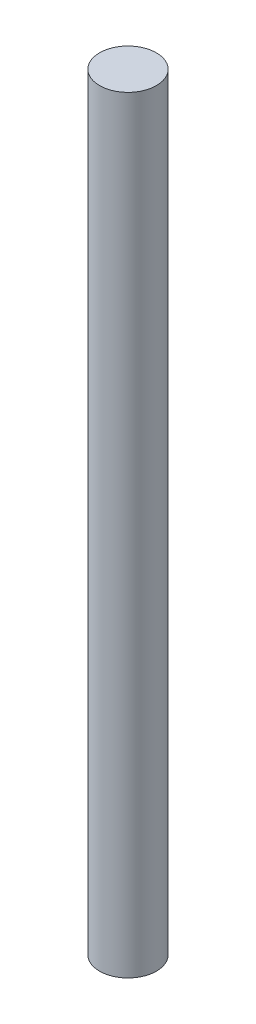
from build123d import *

# Parameters (mm, degrees)
SKIZZE1_R                       = 4
AUFSATZ_LINEAR_AUSTRAGEN1_DEPTH = 108


with BuildPart() as part:
    # Skizze1 → Aufsatz-Linear austragen1 (new body)
    with BuildSketch(Plane(origin=(0, 0, 0), x_dir=(1, 0, 0), z_dir=(0, 1, 0))):
        with Locations(Location((0, 0, 0), (0, 0, 270))):
            Circle(SKIZZE1_R)
    extrude(amount=AUFSATZ_LINEAR_AUSTRAGEN1_DEPTH)


solid = part.part
